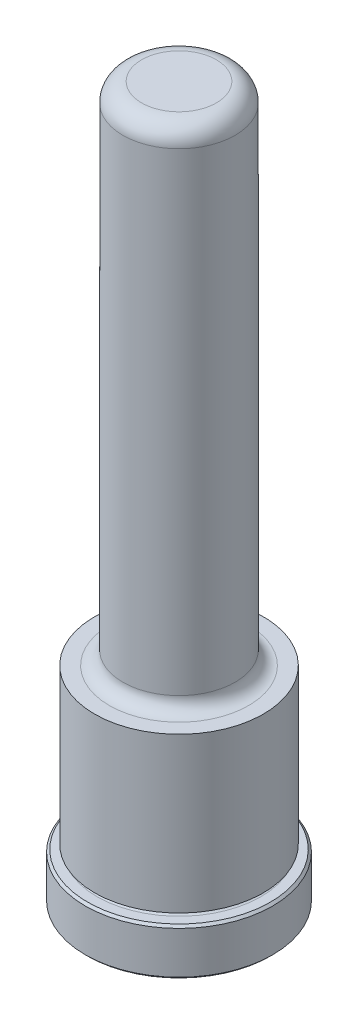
ISO-10303-21;
HEADER;
FILE_DESCRIPTION(('STEP AP214'),'2;1');
FILE_NAME('part.step','',(''),(''),'','','');
FILE_SCHEMA(('AUTOMOTIVE_DESIGN { 1 0 10303 214 1 1 1 1 }'));
ENDSEC;
DATA;
#1=APPLICATION_CONTEXT('core data for automotive mechanical design processes');
#2=APPLICATION_PROTOCOL_DEFINITION('international standard','automotive_design',2000,#1);
#3=PRODUCT_CONTEXT('',#1,'mechanical');
#4=PRODUCT('Part','Part','',(#3));
#5=PRODUCT_RELATED_PRODUCT_CATEGORY('part','',(#4));
#6=PRODUCT_DEFINITION_FORMATION('','',#4);
#7=PRODUCT_DEFINITION_CONTEXT('part definition',#1,'design');
#8=PRODUCT_DEFINITION('design','',#6,#7);
#9=PRODUCT_DEFINITION_SHAPE('','',#8);
#10=(LENGTH_UNIT() NAMED_UNIT(*) SI_UNIT(.MILLI.,.METRE.));
#11=(NAMED_UNIT(*) PLANE_ANGLE_UNIT() SI_UNIT($,.RADIAN.));
#12=(NAMED_UNIT(*) SI_UNIT($,.STERADIAN.) SOLID_ANGLE_UNIT());
#13=UNCERTAINTY_MEASURE_WITH_UNIT(LENGTH_MEASURE(1.E-05),#10,'distance_accuracy_value','');
#14=(GEOMETRIC_REPRESENTATION_CONTEXT(3) GLOBAL_UNCERTAINTY_ASSIGNED_CONTEXT((#13)) GLOBAL_UNIT_ASSIGNED_CONTEXT((#10,
#11,#12)) REPRESENTATION_CONTEXT('',''));
#15=CARTESIAN_POINT('',(0.,0.,0.));
#16=DIRECTION('',(0.,0.,1.));
#17=DIRECTION('',(1.,0.,0.));
#18=AXIS2_PLACEMENT_3D('',#15,#16,#17);
#19=CARTESIAN_POINT('',(0.,0.,0.));
#20=DIRECTION('',(0.,1.,0.));
#21=DIRECTION('',(0.,0.,1.));
#22=AXIS2_PLACEMENT_3D('',#19,#20,#21);
#23=PLANE('',#22);
#24=CARTESIAN_POINT('',(0.,0.,0.));
#25=DIRECTION('',(0.,1.,0.));
#26=DIRECTION('',(0.,0.,1.));
#27=AXIS2_PLACEMENT_3D('',#24,#25,#26);
#28=CIRCLE('',#27,15.494);
#29=CARTESIAN_POINT('',(0.,0.,15.494));
#30=VERTEX_POINT('',#29);
#31=EDGE_CURVE('E46',#30,#30,#28,.F.);
#32=ORIENTED_EDGE('',*,*,#31,.T.);
#33=EDGE_LOOP('',(#32));
#34=FACE_BOUND('',#33,.T.);
#35=ADVANCED_FACE('F31',(#34),#23,.F.);
#36=CARTESIAN_POINT('',(0.,0.,0.));
#37=DIRECTION('',(0.,1.,0.));
#38=DIRECTION('',(0.,0.,1.));
#39=AXIS2_PLACEMENT_3D('',#36,#37,#38);
#40=CYLINDRICAL_SURFACE('',#39,15.875);
#41=CARTESIAN_POINT('',(0.,0.381000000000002,0.));
#42=DIRECTION('',(0.,1.,0.));
#43=DIRECTION('',(0.,0.,1.));
#44=AXIS2_PLACEMENT_3D('',#41,#42,#43);
#45=CIRCLE('',#44,15.875);
#46=CARTESIAN_POINT('',(0.,0.381,15.875));
#47=VERTEX_POINT('',#46);
#48=EDGE_CURVE('E51',#47,#47,#45,.T.);
#49=ORIENTED_EDGE('',*,*,#48,.T.);
#50=EDGE_LOOP('',(#49));
#51=FACE_BOUND('',#50,.T.);
#52=CARTESIAN_POINT('',(0.,7.54379999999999,0.));
#53=DIRECTION('',(0.,-1.,0.));
#54=DIRECTION('',(0.,0.,-1.));
#55=AXIS2_PLACEMENT_3D('',#52,#53,#54);
#56=CIRCLE('',#55,15.875);
#57=CARTESIAN_POINT('',(0.,7.54379999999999,-15.875));
#58=VERTEX_POINT('',#57);
#59=EDGE_CURVE('E54',#58,#58,#56,.T.);
#60=ORIENTED_EDGE('',*,*,#59,.T.);
#61=EDGE_LOOP('',(#60));
#62=FACE_BOUND('',#61,.T.);
#63=ADVANCED_FACE('F110',(#51,#62),#40,.T.);
#64=CARTESIAN_POINT('',(0.,7.9248,-15.875));
#65=DIRECTION('',(0.,-1.,0.));
#66=DIRECTION('',(0.,0.,-1.));
#67=AXIS2_PLACEMENT_3D('',#64,#65,#66);
#68=PLANE('',#67);
#69=CARTESIAN_POINT('',(0.,7.9248,0.));
#70=DIRECTION('',(0.,-1.,0.));
#71=DIRECTION('',(0.,0.,-1.));
#72=AXIS2_PLACEMENT_3D('',#69,#70,#71);
#73=CIRCLE('',#72,15.494);
#74=CARTESIAN_POINT('',(0.,7.9248,-15.494));
#75=VERTEX_POINT('',#74);
#76=EDGE_CURVE('E42',#75,#75,#73,.F.);
#77=ORIENTED_EDGE('',*,*,#76,.T.);
#78=EDGE_LOOP('',(#77));
#79=FACE_BOUND('',#78,.T.);
#80=CARTESIAN_POINT('',(0.,7.9248,0.));
#81=DIRECTION('',(0.,1.,0.));
#82=DIRECTION('',(0.,0.,1.));
#83=AXIS2_PLACEMENT_3D('',#80,#81,#82);
#84=CIRCLE('',#83,13.8938);
#85=CARTESIAN_POINT('',(0.,7.9248,13.8938));
#86=VERTEX_POINT('',#85);
#87=EDGE_CURVE('E57',#86,#86,#84,.T.);
#88=ORIENTED_EDGE('',*,*,#87,.F.);
#89=EDGE_LOOP('',(#88));
#90=FACE_BOUND('',#89,.T.);
#91=ADVANCED_FACE('F105',(#79,#90),#68,.F.);
#92=CARTESIAN_POINT('',(0.,8.3058,0.));
#93=DIRECTION('',(0.,1.,0.));
#94=DIRECTION('',(0.,0.,1.));
#95=AXIS2_PLACEMENT_3D('',#92,#93,#94);
#96=TOROIDAL_SURFACE('',#95,13.8938,0.381000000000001);
#97=CARTESIAN_POINT('',(0.,8.68680000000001,0.));
#98=DIRECTION('',(0.,1.,0.));
#99=DIRECTION('',(0.,0.,1.));
#100=AXIS2_PLACEMENT_3D('',#97,#98,#99);
#101=CIRCLE('',#100,13.8938);
#102=CARTESIAN_POINT('',(0.,8.6868,13.8938));
#103=VERTEX_POINT('',#102);
#104=EDGE_CURVE('E60',#103,#103,#101,.T.);
#105=ORIENTED_EDGE('',*,*,#104,.F.);
#106=EDGE_LOOP('',(#105));
#107=FACE_BOUND('',#106,.T.);
#108=ORIENTED_EDGE('',*,*,#87,.T.);
#109=EDGE_LOOP('',(#108));
#110=FACE_BOUND('',#109,.T.);
#111=ADVANCED_FACE('F99',(#107,#110),#96,.F.);
#112=CARTESIAN_POINT('',(0.,8.68680000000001,-13.8938));
#113=DIRECTION('',(0.,1.,0.));
#114=DIRECTION('',(0.,0.,1.));
#115=AXIS2_PLACEMENT_3D('',#112,#113,#114);
#116=PLANE('',#115);
#117=CARTESIAN_POINT('',(0.,8.6868,0.));
#118=DIRECTION('',(0.,1.,0.));
#119=DIRECTION('',(0.,0.,1.));
#120=AXIS2_PLACEMENT_3D('',#117,#118,#119);
#121=CIRCLE('',#120,14.3002);
#122=CARTESIAN_POINT('',(0.,8.6868,14.3002));
#123=VERTEX_POINT('',#122);
#124=EDGE_CURVE('E63',#123,#123,#121,.T.);
#125=ORIENTED_EDGE('',*,*,#124,.F.);
#126=EDGE_LOOP('',(#125));
#127=FACE_BOUND('',#126,.T.);
#128=ORIENTED_EDGE('',*,*,#104,.T.);
#129=EDGE_LOOP('',(#128));
#130=FACE_BOUND('',#129,.T.);
#131=ADVANCED_FACE('F93',(#127,#130),#116,.F.);
#132=CARTESIAN_POINT('',(0.,0.,0.));
#133=DIRECTION('',(0.,1.,0.));
#134=DIRECTION('',(0.,0.,1.));
#135=AXIS2_PLACEMENT_3D('',#132,#133,#134);
#136=CYLINDRICAL_SURFACE('',#135,14.3002);
#137=CARTESIAN_POINT('',(0.,34.925,0.));
#138=DIRECTION('',(0.,1.,0.));
#139=DIRECTION('',(0.,0.,1.));
#140=AXIS2_PLACEMENT_3D('',#137,#138,#139);
#141=CIRCLE('',#140,14.3002);
#142=CARTESIAN_POINT('',(0.,34.925,14.3002));
#143=VERTEX_POINT('',#142);
#144=EDGE_CURVE('E66',#143,#143,#141,.T.);
#145=ORIENTED_EDGE('',*,*,#144,.F.);
#146=EDGE_LOOP('',(#145));
#147=FACE_BOUND('',#146,.T.);
#148=ORIENTED_EDGE('',*,*,#124,.T.);
#149=EDGE_LOOP('',(#148));
#150=FACE_BOUND('',#149,.T.);
#151=ADVANCED_FACE('F87',(#147,#150),#136,.T.);
#152=CARTESIAN_POINT('',(0.,34.925,-14.3002));
#153=DIRECTION('',(0.,-1.,0.));
#154=DIRECTION('',(0.,0.,-1.));
#155=AXIS2_PLACEMENT_3D('',#152,#153,#154);
#156=PLANE('',#155);
#157=CARTESIAN_POINT('',(0.,34.925,0.));
#158=DIRECTION('',(0.,1.,0.));
#159=DIRECTION('',(0.,0.,1.));
#160=AXIS2_PLACEMENT_3D('',#157,#158,#159);
#161=CIRCLE('',#160,11.7983);
#162=CARTESIAN_POINT('',(0.,34.925,11.7983));
#163=VERTEX_POINT('',#162);
#164=EDGE_CURVE('E69',#163,#163,#161,.T.);
#165=ORIENTED_EDGE('',*,*,#164,.F.);
#166=EDGE_LOOP('',(#165));
#167=FACE_BOUND('',#166,.T.);
#168=ORIENTED_EDGE('',*,*,#144,.T.);
#169=EDGE_LOOP('',(#168));
#170=FACE_BOUND('',#169,.T.);
#171=ADVANCED_FACE('F81',(#167,#170),#156,.F.);
#172=CARTESIAN_POINT('',(0.,37.211,0.));
#173=DIRECTION('',(0.,1.,0.));
#174=DIRECTION('',(0.,0.,1.));
#175=AXIS2_PLACEMENT_3D('',#172,#173,#174);
#176=TOROIDAL_SURFACE('',#175,11.7983,2.28599999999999);
#177=CARTESIAN_POINT('',(0.,37.211,0.));
#178=DIRECTION('',(0.,1.,0.));
#179=DIRECTION('',(0.,0.,1.));
#180=AXIS2_PLACEMENT_3D('',#177,#178,#179);
#181=CIRCLE('',#180,9.51230000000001);
#182=CARTESIAN_POINT('',(0.,37.211,9.51230000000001));
#183=VERTEX_POINT('',#182);
#184=EDGE_CURVE('E72',#183,#183,#181,.T.);
#185=ORIENTED_EDGE('',*,*,#184,.F.);
#186=EDGE_LOOP('',(#185));
#187=FACE_BOUND('',#186,.T.);
#188=ORIENTED_EDGE('',*,*,#164,.T.);
#189=EDGE_LOOP('',(#188));
#190=FACE_BOUND('',#189,.T.);
#191=ADVANCED_FACE('F78',(#187,#190),#176,.F.);
#192=CARTESIAN_POINT('',(0.,0.,0.));
#193=DIRECTION('',(0.,1.,0.));
#194=DIRECTION('',(0.,0.,1.));
#195=AXIS2_PLACEMENT_3D('',#192,#193,#194);
#196=CYLINDRICAL_SURFACE('',#195,9.51230000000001);
#197=CARTESIAN_POINT('',(0.,117.475,0.));
#198=DIRECTION('',(0.,-1.,0.));
#199=DIRECTION('',(0.,0.,-1.));
#200=AXIS2_PLACEMENT_3D('',#197,#198,#199);
#201=CIRCLE('',#200,9.51230000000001);
#202=CARTESIAN_POINT('',(0.,117.475,-9.51229999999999));
#203=VERTEX_POINT('',#202);
#204=EDGE_CURVE('E10',#203,#203,#201,.T.);
#205=ORIENTED_EDGE('',*,*,#204,.T.);
#206=EDGE_LOOP('',(#205));
#207=FACE_BOUND('',#206,.T.);
#208=ORIENTED_EDGE('',*,*,#184,.T.);
#209=EDGE_LOOP('',(#208));
#210=FACE_BOUND('',#209,.T.);
#211=ADVANCED_FACE('F76',(#207,#210),#196,.T.);
#212=CARTESIAN_POINT('',(0.,120.65,-9.51229999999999));
#213=DIRECTION('',(0.,-1.,0.));
#214=DIRECTION('',(0.,0.,-1.));
#215=AXIS2_PLACEMENT_3D('',#212,#213,#214);
#216=PLANE('',#215);
#217=CARTESIAN_POINT('',(0.,120.65,0.));
#218=DIRECTION('',(0.,-1.,0.));
#219=DIRECTION('',(0.,0.,-1.));
#220=AXIS2_PLACEMENT_3D('',#217,#218,#219);
#221=CIRCLE('',#220,6.33730000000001);
#222=CARTESIAN_POINT('',(0.,120.65,-6.3373));
#223=VERTEX_POINT('',#222);
#224=EDGE_CURVE('E38',#223,#223,#221,.F.);
#225=ORIENTED_EDGE('',*,*,#224,.T.);
#226=EDGE_LOOP('',(#225));
#227=FACE_BOUND('',#226,.T.);
#228=ADVANCED_FACE('F127',(#227),#216,.F.);
#229=CARTESIAN_POINT('',(0.,0.381000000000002,0.));
#230=DIRECTION('',(0.,1.,0.));
#231=DIRECTION('',(0.,0.,1.));
#232=AXIS2_PLACEMENT_3D('',#229,#230,#231);
#233=CONICAL_SURFACE('',#232,15.875,0.785398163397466);
#234=ORIENTED_EDGE('',*,*,#31,.F.);
#235=EDGE_LOOP('',(#234));
#236=FACE_BOUND('',#235,.T.);
#237=ORIENTED_EDGE('',*,*,#48,.F.);
#238=EDGE_LOOP('',(#237));
#239=FACE_BOUND('',#238,.T.);
#240=ADVANCED_FACE('F124',(#236,#239),#233,.T.);
#241=CARTESIAN_POINT('',(0.,7.9248,0.));
#242=DIRECTION('',(0.,-1.,0.));
#243=DIRECTION('',(0.,0.,-1.));
#244=AXIS2_PLACEMENT_3D('',#241,#242,#243);
#245=CONICAL_SURFACE('',#244,15.494,0.785398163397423);
#246=ORIENTED_EDGE('',*,*,#59,.F.);
#247=EDGE_LOOP('',(#246));
#248=FACE_BOUND('',#247,.T.);
#249=ORIENTED_EDGE('',*,*,#76,.F.);
#250=EDGE_LOOP('',(#249));
#251=FACE_BOUND('',#250,.T.);
#252=ADVANCED_FACE('F126',(#248,#251),#245,.T.);
#253=CARTESIAN_POINT('',(0.,117.475,0.));
#254=DIRECTION('',(0.,-1.,0.));
#255=DIRECTION('',(0.,0.,-1.));
#256=AXIS2_PLACEMENT_3D('',#253,#254,#255);
#257=TOROIDAL_SURFACE('',#256,6.33730000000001,3.175);
#258=ORIENTED_EDGE('',*,*,#204,.F.);
#259=EDGE_LOOP('',(#258));
#260=FACE_BOUND('',#259,.T.);
#261=ORIENTED_EDGE('',*,*,#224,.F.);
#262=EDGE_LOOP('',(#261));
#263=FACE_BOUND('',#262,.T.);
#264=ADVANCED_FACE('F33',(#260,#263),#257,.T.);
#265=CLOSED_SHELL('',(#35,#63,#91,#111,#131,#151,#171,#191,#211,#228,#240,#252,#264));
#266=MANIFOLD_SOLID_BREP('B2',#265);
#267=ADVANCED_BREP_SHAPE_REPRESENTATION('',(#18,#266),#14);
#268=SHAPE_DEFINITION_REPRESENTATION(#9,#267);
ENDSEC;
END-ISO-10303-21;
